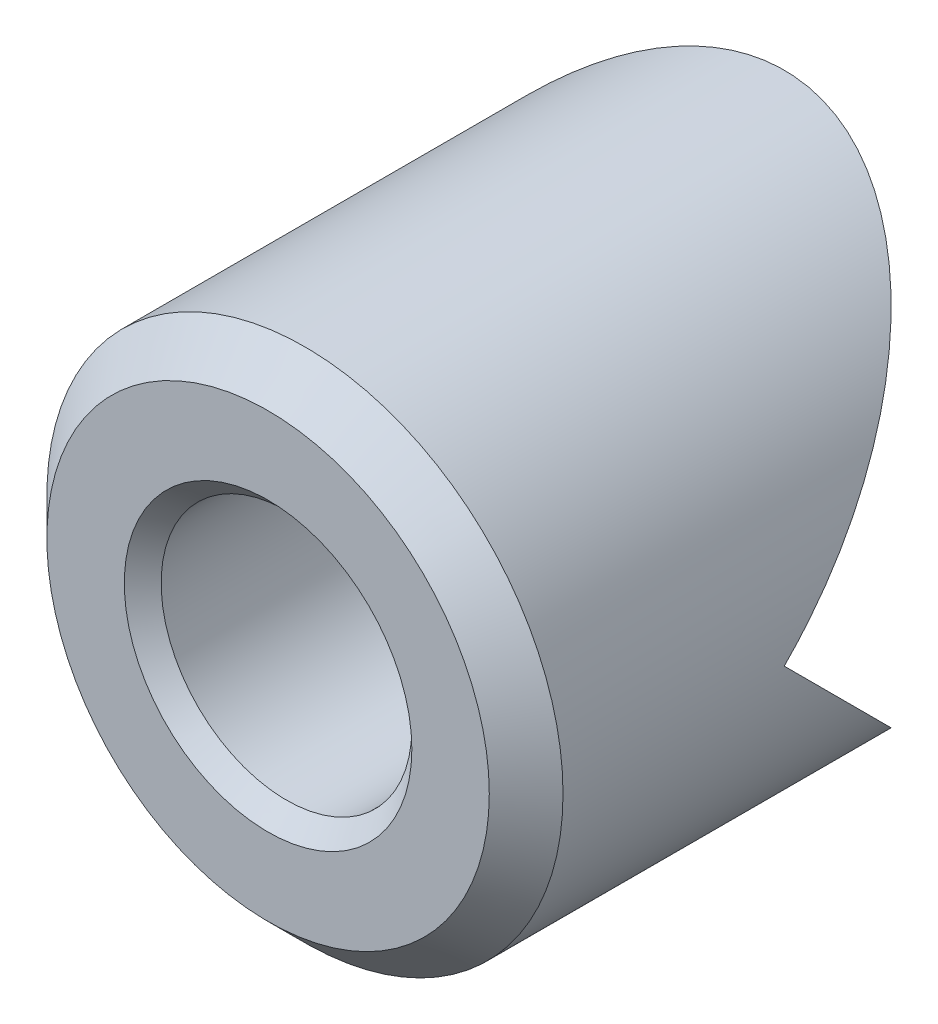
ISO-10303-21;
HEADER;
FILE_DESCRIPTION(('STEP AP214'),'2;1');
FILE_NAME('part.step','',(''),(''),'','','');
FILE_SCHEMA(('AUTOMOTIVE_DESIGN { 1 0 10303 214 1 1 1 1 }'));
ENDSEC;
DATA;
#1=APPLICATION_CONTEXT('core data for automotive mechanical design processes');
#2=APPLICATION_PROTOCOL_DEFINITION('international standard','automotive_design',2000,#1);
#3=PRODUCT_CONTEXT('',#1,'mechanical');
#4=PRODUCT('Part','Part','',(#3));
#5=PRODUCT_RELATED_PRODUCT_CATEGORY('part','',(#4));
#6=PRODUCT_DEFINITION_FORMATION('','',#4);
#7=PRODUCT_DEFINITION_CONTEXT('part definition',#1,'design');
#8=PRODUCT_DEFINITION('design','',#6,#7);
#9=PRODUCT_DEFINITION_SHAPE('','',#8);
#10=(LENGTH_UNIT() NAMED_UNIT(*) SI_UNIT(.MILLI.,.METRE.));
#11=(NAMED_UNIT(*) PLANE_ANGLE_UNIT() SI_UNIT($,.RADIAN.));
#12=(NAMED_UNIT(*) SI_UNIT($,.STERADIAN.) SOLID_ANGLE_UNIT());
#13=UNCERTAINTY_MEASURE_WITH_UNIT(LENGTH_MEASURE(1.E-05),#10,'distance_accuracy_value','');
#14=(GEOMETRIC_REPRESENTATION_CONTEXT(3) GLOBAL_UNCERTAINTY_ASSIGNED_CONTEXT((#13)) GLOBAL_UNIT_ASSIGNED_CONTEXT((#10,
#11,#12)) REPRESENTATION_CONTEXT('',''));
#15=CARTESIAN_POINT('',(0.,0.,0.));
#16=DIRECTION('',(0.,0.,1.));
#17=DIRECTION('',(1.,0.,0.));
#18=AXIS2_PLACEMENT_3D('',#15,#16,#17);
#19=CARTESIAN_POINT('',(0.,0.,14.));
#20=DIRECTION('',(0.,0.,-1.));
#21=DIRECTION('',(-1.,0.,0.));
#22=AXIS2_PLACEMENT_3D('',#19,#20,#21);
#23=CYLINDRICAL_SURFACE('',#22,7.);
#24=CARTESIAN_POINT('',(0.,0.,13.));
#25=DIRECTION('',(0.,0.,1.));
#26=DIRECTION('',(1.,0.,0.));
#27=AXIS2_PLACEMENT_3D('',#24,#25,#26);
#28=CIRCLE('',#27,7.);
#29=CARTESIAN_POINT('',(7.,0.,13.));
#30=VERTEX_POINT('',#29);
#31=EDGE_CURVE('E65',#30,#30,#28,.F.);
#32=ORIENTED_EDGE('',*,*,#31,.T.);
#33=EDGE_LOOP('',(#32));
#34=FACE_BOUND('',#33,.T.);
#35=CARTESIAN_POINT('',(0.,0.,7.00000000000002));
#36=DIRECTION('',(0.,0.707106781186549,-0.707106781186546));
#37=DIRECTION('',(0.,-0.707106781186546,-0.707106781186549));
#38=AXIS2_PLACEMENT_3D('',#35,#36,#37);
#39=ELLIPSE('',#38,9.89949493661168,7.);
#40=CARTESIAN_POINT('',(7.00000000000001,0.,7.00000000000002));
#41=VERTEX_POINT('',#40);
#42=CARTESIAN_POINT('',(-6.99999999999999,0.,7.00000000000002));
#43=VERTEX_POINT('',#42);
#44=EDGE_CURVE('E72',#41,#43,#39,.T.);
#45=ORIENTED_EDGE('',*,*,#44,.F.);
#46=CARTESIAN_POINT('',(0.,0.,7.00000000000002));
#47=DIRECTION('',(0.,-0.707106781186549,-0.707106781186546));
#48=DIRECTION('',(0.,0.707106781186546,-0.707106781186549));
#49=AXIS2_PLACEMENT_3D('',#46,#47,#48);
#50=ELLIPSE('',#49,9.89949493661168,7.);
#51=EDGE_CURVE('E77',#43,#41,#50,.T.);
#52=ORIENTED_EDGE('',*,*,#51,.F.);
#53=EDGE_LOOP('',(#45,#52));
#54=FACE_BOUND('',#53,.T.);
#55=ADVANCED_FACE('F34',(#34,#54),#23,.T.);
#56=CARTESIAN_POINT('',(0.,0.,14.));
#57=DIRECTION('',(0.,0.,1.));
#58=DIRECTION('',(1.,0.,0.));
#59=AXIS2_PLACEMENT_3D('',#56,#57,#58);
#60=PLANE('',#59);
#61=CARTESIAN_POINT('',(0.,0.,14.));
#62=DIRECTION('',(0.,0.,1.));
#63=DIRECTION('',(1.,0.,0.));
#64=AXIS2_PLACEMENT_3D('',#61,#62,#63);
#65=CIRCLE('',#64,3.89999999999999);
#66=CARTESIAN_POINT('',(3.89999999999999,0.,14.));
#67=VERTEX_POINT('',#66);
#68=EDGE_CURVE('E11',#67,#67,#65,.F.);
#69=ORIENTED_EDGE('',*,*,#68,.T.);
#70=EDGE_LOOP('',(#69));
#71=FACE_BOUND('',#70,.T.);
#72=CARTESIAN_POINT('',(0.,0.,14.));
#73=DIRECTION('',(0.,0.,1.));
#74=DIRECTION('',(1.,0.,0.));
#75=AXIS2_PLACEMENT_3D('',#72,#73,#74);
#76=CIRCLE('',#75,5.99999999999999);
#77=CARTESIAN_POINT('',(5.99999999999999,0.,14.));
#78=VERTEX_POINT('',#77);
#79=EDGE_CURVE('E79',#78,#78,#76,.T.);
#80=ORIENTED_EDGE('',*,*,#79,.T.);
#81=EDGE_LOOP('',(#80));
#82=FACE_BOUND('',#81,.T.);
#83=ADVANCED_FACE('F95',(#71,#82),#60,.T.);
#84=CARTESIAN_POINT('',(0.,0.,14.));
#85=DIRECTION('',(0.,0.,-1.));
#86=DIRECTION('',(-1.,0.,0.));
#87=AXIS2_PLACEMENT_3D('',#84,#85,#86);
#88=CONICAL_SURFACE('',#87,5.99999999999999,0.785398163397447);
#89=ORIENTED_EDGE('',*,*,#31,.F.);
#90=EDGE_LOOP('',(#89));
#91=FACE_BOUND('',#90,.T.);
#92=ORIENTED_EDGE('',*,*,#79,.F.);
#93=EDGE_LOOP('',(#92));
#94=FACE_BOUND('',#93,.T.);
#95=ADVANCED_FACE('F101',(#91,#94),#88,.T.);
#96=CARTESIAN_POINT('',(39.0608891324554,7.,0.));
#97=DIRECTION('',(0.,-0.707106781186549,-0.707106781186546));
#98=DIRECTION('',(0.,0.707106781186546,-0.707106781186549));
#99=AXIS2_PLACEMENT_3D('',#96,#97,#98);
#100=PLANE('',#99);
#101=CARTESIAN_POINT('',(0.,0.,7.00000000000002));
#102=DIRECTION('',(0.,-0.707106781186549,-0.707106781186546));
#103=DIRECTION('',(0.,-0.707106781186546,0.707106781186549));
#104=AXIS2_PLACEMENT_3D('',#101,#102,#103);
#105=ELLIPSE('',#104,4.80832611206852,3.39999999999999);
#106=CARTESIAN_POINT('',(-3.39999999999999,0.,7.00000000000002));
#107=VERTEX_POINT('',#106);
#108=CARTESIAN_POINT('',(3.4,0.,7.00000000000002));
#109=VERTEX_POINT('',#108);
#110=EDGE_CURVE('E48',#107,#109,#105,.T.);
#111=ORIENTED_EDGE('',*,*,#110,.F.);
#112=DIRECTION('',(-1.,0.,0.));
#113=VECTOR('',#112,1.);
#114=CARTESIAN_POINT('',(39.0608891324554,0.,7.00000000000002));
#115=LINE('',#114,#113);
#116=EDGE_CURVE('E55',#107,#43,#115,.T.);
#117=ORIENTED_EDGE('',*,*,#116,.T.);
#118=ORIENTED_EDGE('',*,*,#51,.T.);
#119=EDGE_CURVE('E68',#41,#109,#115,.T.);
#120=ORIENTED_EDGE('',*,*,#119,.T.);
#121=EDGE_LOOP('',(#111,#117,#118,#120));
#122=FACE_BOUND('',#121,.T.);
#123=ADVANCED_FACE('F67',(#122),#100,.T.);
#124=CARTESIAN_POINT('',(39.0608891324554,0.,7.00000000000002));
#125=DIRECTION('',(0.,0.707106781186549,-0.707106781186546));
#126=DIRECTION('',(0.,0.707106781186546,0.707106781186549));
#127=AXIS2_PLACEMENT_3D('',#124,#125,#126);
#128=PLANE('',#127);
#129=CARTESIAN_POINT('',(0.,0.,7.00000000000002));
#130=DIRECTION('',(0.,0.707106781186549,-0.707106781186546));
#131=DIRECTION('',(0.,0.707106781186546,0.707106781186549));
#132=AXIS2_PLACEMENT_3D('',#129,#130,#131);
#133=ELLIPSE('',#132,4.80832611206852,3.39999999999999);
#134=EDGE_CURVE('E60',#109,#107,#133,.T.);
#135=ORIENTED_EDGE('',*,*,#134,.F.);
#136=ORIENTED_EDGE('',*,*,#119,.F.);
#137=ORIENTED_EDGE('',*,*,#44,.T.);
#138=ORIENTED_EDGE('',*,*,#116,.F.);
#139=EDGE_LOOP('',(#135,#136,#137,#138));
#140=FACE_BOUND('',#139,.T.);
#141=ADVANCED_FACE('F70',(#140),#128,.T.);
#142=CARTESIAN_POINT('',(0.,0.,14.));
#143=DIRECTION('',(0.,0.,1.));
#144=DIRECTION('',(1.,0.,0.));
#145=AXIS2_PLACEMENT_3D('',#142,#143,#144);
#146=CYLINDRICAL_SURFACE('',#145,3.39999999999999);
#147=CARTESIAN_POINT('',(0.,0.,13.5));
#148=DIRECTION('',(0.,0.,1.));
#149=DIRECTION('',(1.,0.,0.));
#150=AXIS2_PLACEMENT_3D('',#147,#148,#149);
#151=CIRCLE('',#150,3.39999999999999);
#152=CARTESIAN_POINT('',(3.39999999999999,0.,13.5));
#153=VERTEX_POINT('',#152);
#154=EDGE_CURVE('E42',#153,#153,#151,.T.);
#155=ORIENTED_EDGE('',*,*,#154,.T.);
#156=EDGE_LOOP('',(#155));
#157=FACE_BOUND('',#156,.T.);
#158=ORIENTED_EDGE('',*,*,#110,.T.);
#159=ORIENTED_EDGE('',*,*,#134,.T.);
#160=EDGE_LOOP('',(#158,#159));
#161=FACE_BOUND('',#160,.T.);
#162=ADVANCED_FACE('F61',(#157,#161),#146,.F.);
#163=CARTESIAN_POINT('',(0.,0.,13.5));
#164=DIRECTION('',(0.,0.,1.));
#165=DIRECTION('',(1.,0.,0.));
#166=AXIS2_PLACEMENT_3D('',#163,#164,#165);
#167=CONICAL_SURFACE('',#166,3.39999999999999,0.78539816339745);
#168=ORIENTED_EDGE('',*,*,#68,.F.);
#169=EDGE_LOOP('',(#168));
#170=FACE_BOUND('',#169,.T.);
#171=ORIENTED_EDGE('',*,*,#154,.F.);
#172=EDGE_LOOP('',(#171));
#173=FACE_BOUND('',#172,.T.);
#174=ADVANCED_FACE('F36',(#170,#173),#167,.F.);
#175=CLOSED_SHELL('',(#55,#83,#95,#123,#141,#162,#174));
#176=MANIFOLD_SOLID_BREP('B2',#175);
#177=ADVANCED_BREP_SHAPE_REPRESENTATION('',(#18,#176),#14);
#178=SHAPE_DEFINITION_REPRESENTATION(#9,#177);
ENDSEC;
END-ISO-10303-21;
